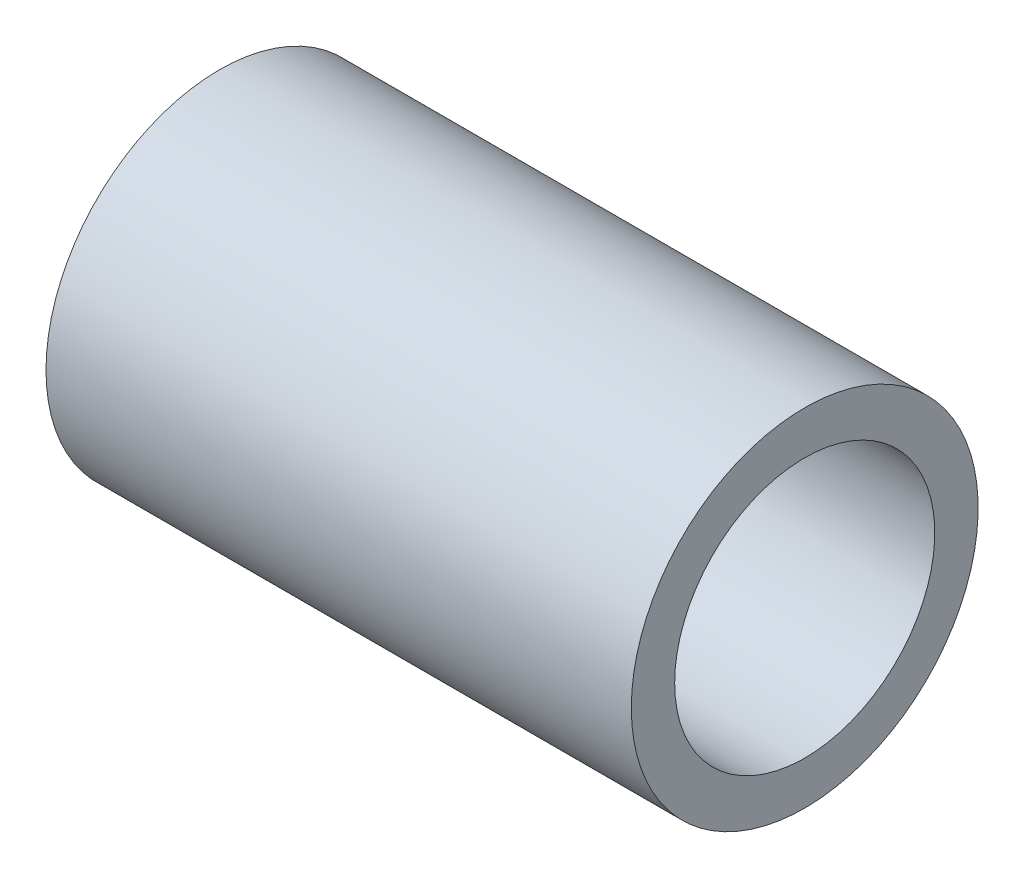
from build123d import *

# Parameters (mm, degrees)
SKETCH1_W          = 13.5
SKETCH1_H          = 1
CUT_EXTRUDE2_DEPTH = 15.637281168


with BuildPart() as part:
    # Sketch1 → Revolve1 (revolve)
    with BuildSketch(Plane.XY, mode=Mode.PRIVATE) as revolve1_sk:
        with Locations((6.75, 3.5)):
            Rectangle(SKETCH1_W, SKETCH1_H)
    revolve(revolve1_sk.sketch.rotate(Axis((-6.900875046, 0, 0), (1, 0, 0)), 90), axis=Axis((-6.900875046, 0, 0), (1, 0, 0)))

    # Sketch3 → Cut-Extrude2 (cut, through all)
    with BuildSketch(Plane.XY):
        with BuildLine():
            Line((0, 1), (6.5, 1))
            ThreePointArc((6.5, 1), (7.5, 0), (6.5, -1))
            Line((6.5, -1), (0, -1))
            Line((0, -1), (0, 1))
        make_face()
    extrude(amount=-CUT_EXTRUDE2_DEPTH, mode=Mode.SUBTRACT)


solid = part.part
